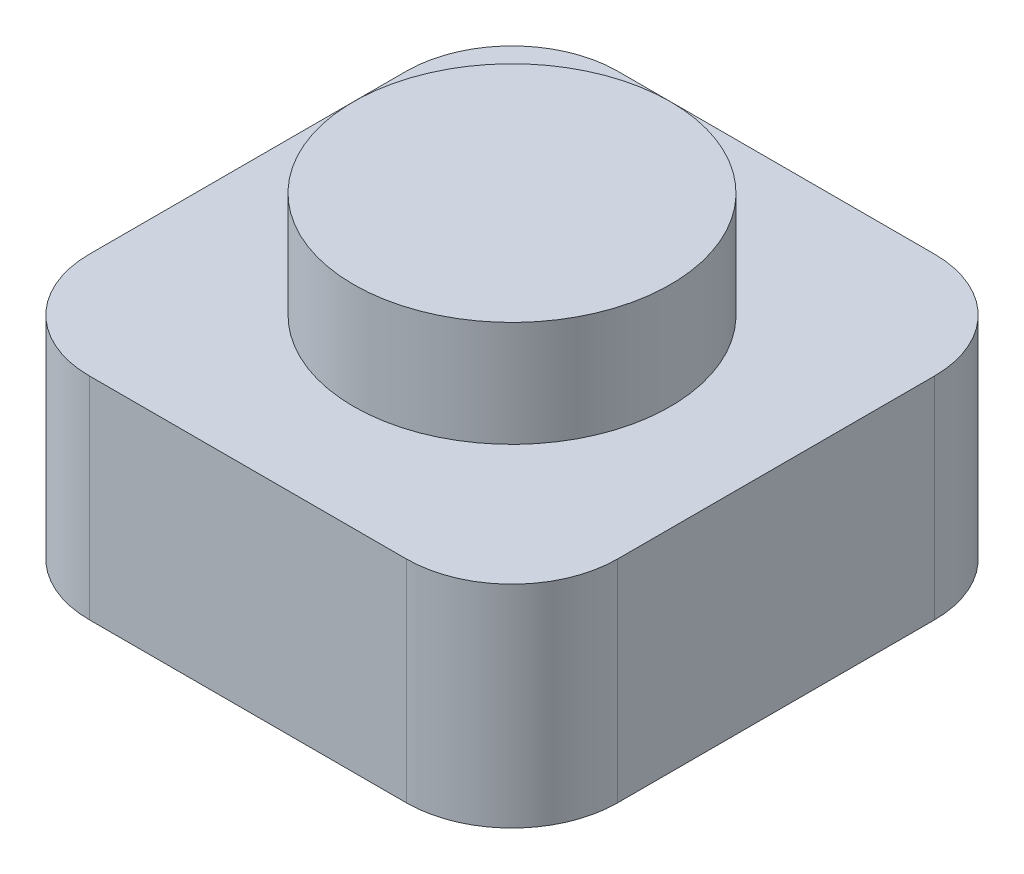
from build123d import *

# Parameters (mm, degrees)
EXTRUDE_1_DEPTH = 4
SKETCH_2_R      = 3
EXTRUDE_2_DEPTH = 2


with BuildPart() as part:
    # Sketch 1 → Extrude 1 (new body)
    with BuildSketch(Plane(origin=(0, 0, 0), x_dir=(1, 0, 0), z_dir=(0, 1, 0))):
        with BuildLine():
            Line((-3.991735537, -6.756198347), (2.008264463, -6.756198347))
            ThreePointArc((2.008264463, -6.756198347), (3.422478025, -6.170411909), (4.008264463, -4.756198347))
            Line((4.008264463, -4.756198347), (4.008264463, 1.243801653))
            ThreePointArc((4.008264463, 1.243801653), (3.422478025, 2.658015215), (2.008264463, 3.243801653))
            Line((2.008264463, 3.243801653), (-3.991735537, 3.243801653))
            ThreePointArc((-3.991735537, 3.243801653), (-5.4059491, 2.658015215), (-5.991735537, 1.243801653))
            Line((-5.991735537, 1.243801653), (-5.991735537, -4.756198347))
            ThreePointArc((-5.991735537, -4.756198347), (-5.4059491, -6.170411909), (-3.991735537, -6.756198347))
        make_face()
    extrude(amount=EXTRUDE_1_DEPTH)

    # Sketch 2 → Extrude 2 (add)
    with BuildSketch(Plane(origin=(0, 4, 0), x_dir=(1, 0, 0), z_dir=(0, 1, 0))):
        with Locations(Location((-0.991735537, -1.756198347, 0), (0, 0, 270))):
            Circle(SKETCH_2_R)
    extrude(amount=EXTRUDE_2_DEPTH)


solid = part.part
